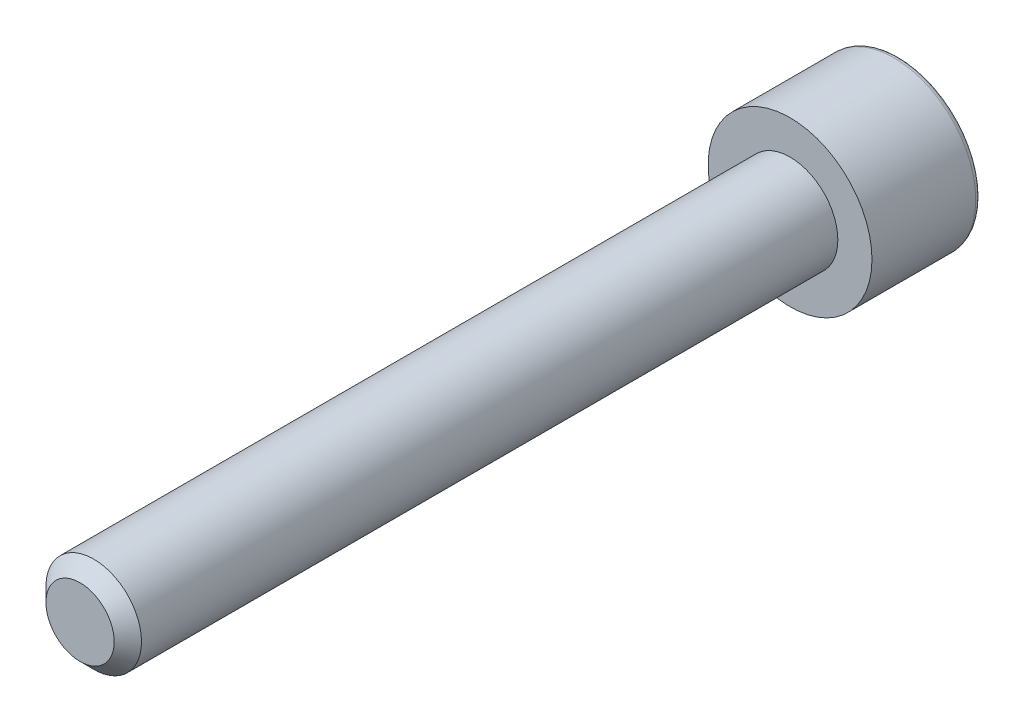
ISO-10303-21;
HEADER;
FILE_DESCRIPTION(('STEP AP214'),'2;1');
FILE_NAME('part.step','',(''),(''),'','','');
FILE_SCHEMA(('AUTOMOTIVE_DESIGN { 1 0 10303 214 1 1 1 1 }'));
ENDSEC;
DATA;
#1=APPLICATION_CONTEXT('core data for automotive mechanical design processes');
#2=APPLICATION_PROTOCOL_DEFINITION('international standard','automotive_design',2000,#1);
#3=PRODUCT_CONTEXT('',#1,'mechanical');
#4=PRODUCT('Part','Part','',(#3));
#5=PRODUCT_RELATED_PRODUCT_CATEGORY('part','',(#4));
#6=PRODUCT_DEFINITION_FORMATION('','',#4);
#7=PRODUCT_DEFINITION_CONTEXT('part definition',#1,'design');
#8=PRODUCT_DEFINITION('design','',#6,#7);
#9=PRODUCT_DEFINITION_SHAPE('','',#8);
#10=(LENGTH_UNIT() NAMED_UNIT(*) SI_UNIT(.MILLI.,.METRE.));
#11=(NAMED_UNIT(*) PLANE_ANGLE_UNIT() SI_UNIT($,.RADIAN.));
#12=(NAMED_UNIT(*) SI_UNIT($,.STERADIAN.) SOLID_ANGLE_UNIT());
#13=UNCERTAINTY_MEASURE_WITH_UNIT(LENGTH_MEASURE(1.E-05),#10,'distance_accuracy_value','');
#14=(GEOMETRIC_REPRESENTATION_CONTEXT(3) GLOBAL_UNCERTAINTY_ASSIGNED_CONTEXT((#13)) GLOBAL_UNIT_ASSIGNED_CONTEXT((#10,
#11,#12)) REPRESENTATION_CONTEXT('',''));
#15=CARTESIAN_POINT('',(0.,0.,0.));
#16=DIRECTION('',(0.,0.,1.));
#17=DIRECTION('',(1.,0.,0.));
#18=AXIS2_PLACEMENT_3D('',#15,#16,#17);
#19=CARTESIAN_POINT('',(0.,0.,30.));
#20=DIRECTION('',(0.,0.,-1.));
#21=DIRECTION('',(-1.,0.,0.));
#22=AXIS2_PLACEMENT_3D('',#19,#20,#21);
#23=CYLINDRICAL_SURFACE('',#22,3.);
#24=CARTESIAN_POINT('',(0.,0.,0.199999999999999));
#25=DIRECTION('',(0.,0.,1.));
#26=DIRECTION('',(1.,0.,0.));
#27=AXIS2_PLACEMENT_3D('',#24,#25,#26);
#28=CIRCLE('',#27,3.);
#29=CARTESIAN_POINT('',(3.,0.,0.199999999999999));
#30=VERTEX_POINT('',#29);
#31=EDGE_CURVE('E146',#30,#30,#28,.T.);
#32=ORIENTED_EDGE('',*,*,#31,.T.);
#33=EDGE_LOOP('',(#32));
#34=FACE_BOUND('',#33,.T.);
#35=CARTESIAN_POINT('',(0.,0.,4.));
#36=DIRECTION('',(0.,0.,1.));
#37=DIRECTION('',(1.,0.,0.));
#38=AXIS2_PLACEMENT_3D('',#35,#36,#37);
#39=CIRCLE('',#38,3.);
#40=CARTESIAN_POINT('',(3.,0.,4.));
#41=VERTEX_POINT('',#40);
#42=EDGE_CURVE('E183',#41,#41,#39,.T.);
#43=ORIENTED_EDGE('',*,*,#42,.F.);
#44=EDGE_LOOP('',(#43));
#45=FACE_BOUND('',#44,.T.);
#46=ADVANCED_FACE('F34',(#34,#45),#23,.T.);
#47=CARTESIAN_POINT('',(0.,0.,0.));
#48=DIRECTION('',(0.,0.,1.));
#49=DIRECTION('',(1.,0.,0.));
#50=AXIS2_PLACEMENT_3D('',#47,#48,#49);
#51=PLANE('',#50);
#52=DIRECTION('',(-0.5,0.866025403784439,0.));
#53=VECTOR('',#52,1.);
#54=CARTESIAN_POINT('',(-1.01036297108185,-1.75,0.));
#55=LINE('',#54,#53);
#56=CARTESIAN_POINT('',(-1.01036297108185,-1.75,0.));
#57=VERTEX_POINT('',#56);
#58=CARTESIAN_POINT('',(-2.02072594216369,0.,0.));
#59=VERTEX_POINT('',#58);
#60=EDGE_CURVE('E122',#57,#59,#55,.T.);
#61=ORIENTED_EDGE('',*,*,#60,.F.);
#62=DIRECTION('',(-1.,0.,0.));
#63=VECTOR('',#62,1.);
#64=CARTESIAN_POINT('',(1.01036297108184,-1.75,0.));
#65=LINE('',#64,#63);
#66=CARTESIAN_POINT('',(1.01036297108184,-1.75,0.));
#67=VERTEX_POINT('',#66);
#68=EDGE_CURVE('E127',#67,#57,#65,.T.);
#69=ORIENTED_EDGE('',*,*,#68,.F.);
#70=DIRECTION('',(-0.5,-0.866025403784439,0.));
#71=VECTOR('',#70,1.);
#72=CARTESIAN_POINT('',(2.02072594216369,0.,0.));
#73=LINE('',#72,#71);
#74=CARTESIAN_POINT('',(2.02072594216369,0.,0.));
#75=VERTEX_POINT('',#74);
#76=EDGE_CURVE('E141',#75,#67,#73,.T.);
#77=ORIENTED_EDGE('',*,*,#76,.F.);
#78=DIRECTION('',(0.5,-0.866025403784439,0.));
#79=VECTOR('',#78,1.);
#80=CARTESIAN_POINT('',(1.01036297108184,1.75,0.));
#81=LINE('',#80,#79);
#82=CARTESIAN_POINT('',(1.01036297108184,1.75,0.));
#83=VERTEX_POINT('',#82);
#84=EDGE_CURVE('E135',#83,#75,#81,.T.);
#85=ORIENTED_EDGE('',*,*,#84,.F.);
#86=DIRECTION('',(1.,0.,0.));
#87=VECTOR('',#86,1.);
#88=CARTESIAN_POINT('',(-1.01036297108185,1.75,0.));
#89=LINE('',#88,#87);
#90=CARTESIAN_POINT('',(-1.01036297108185,1.75,0.));
#91=VERTEX_POINT('',#90);
#92=EDGE_CURVE('E133',#91,#83,#89,.T.);
#93=ORIENTED_EDGE('',*,*,#92,.F.);
#94=DIRECTION('',(0.5,0.866025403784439,0.));
#95=VECTOR('',#94,1.);
#96=CARTESIAN_POINT('',(-2.02072594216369,0.,0.));
#97=LINE('',#96,#95);
#98=EDGE_CURVE('E111',#59,#91,#97,.T.);
#99=ORIENTED_EDGE('',*,*,#98,.F.);
#100=EDGE_LOOP('',(#61,#69,#77,#85,#93,#99));
#101=FACE_BOUND('',#100,.T.);
#102=CARTESIAN_POINT('',(0.,0.,0.));
#103=DIRECTION('',(0.,0.,1.));
#104=DIRECTION('',(1.,0.,0.));
#105=AXIS2_PLACEMENT_3D('',#102,#103,#104);
#106=CIRCLE('',#105,2.8);
#107=CARTESIAN_POINT('',(2.8,0.,0.));
#108=VERTEX_POINT('',#107);
#109=EDGE_CURVE('E155',#108,#108,#106,.F.);
#110=ORIENTED_EDGE('',*,*,#109,.T.);
#111=EDGE_LOOP('',(#110));
#112=FACE_BOUND('',#111,.T.);
#113=ADVANCED_FACE('F129',(#101,#112),#51,.F.);
#114=CARTESIAN_POINT('',(0.,0.,0.199999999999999));
#115=DIRECTION('',(0.,0.,1.));
#116=DIRECTION('',(1.,0.,0.));
#117=AXIS2_PLACEMENT_3D('',#114,#115,#116);
#118=TOROIDAL_SURFACE('',#117,2.8,0.2);
#119=ORIENTED_EDGE('',*,*,#109,.F.);
#120=EDGE_LOOP('',(#119));
#121=FACE_BOUND('',#120,.T.);
#122=ORIENTED_EDGE('',*,*,#31,.F.);
#123=EDGE_LOOP('',(#122));
#124=FACE_BOUND('',#123,.T.);
#125=ADVANCED_FACE('F218',(#121,#124),#118,.T.);
#126=CARTESIAN_POINT('',(1.01036297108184,-1.75,3.5));
#127=DIRECTION('',(0.,-1.,0.));
#128=DIRECTION('',(1.,0.,0.));
#129=AXIS2_PLACEMENT_3D('',#126,#127,#128);
#130=PLANE('',#129);
#131=DIRECTION('',(0.,0.,-1.));
#132=VECTOR('',#131,1.);
#133=CARTESIAN_POINT('',(-1.01036297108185,-1.75,3.5));
#134=LINE('',#133,#132);
#135=CARTESIAN_POINT('',(-1.01036297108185,-1.75,3.3));
#136=VERTEX_POINT('',#135);
#137=EDGE_CURVE('E119',#136,#57,#134,.T.);
#138=ORIENTED_EDGE('',*,*,#137,.F.);
#139=DIRECTION('',(-1.,0.,0.));
#140=VECTOR('',#139,1.);
#141=CARTESIAN_POINT('',(1.01036297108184,-1.75,3.3));
#142=LINE('',#141,#140);
#143=CARTESIAN_POINT('',(1.01036297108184,-1.75,3.3));
#144=VERTEX_POINT('',#143);
#145=EDGE_CURVE('E57',#136,#144,#142,.F.);
#146=ORIENTED_EDGE('',*,*,#145,.T.);
#147=DIRECTION('',(0.,0.,-1.));
#148=VECTOR('',#147,1.);
#149=CARTESIAN_POINT('',(1.01036297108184,-1.75,3.5));
#150=LINE('',#149,#148);
#151=EDGE_CURVE('E144',#144,#67,#150,.T.);
#152=ORIENTED_EDGE('',*,*,#151,.T.);
#153=ORIENTED_EDGE('',*,*,#68,.T.);
#154=EDGE_LOOP('',(#138,#146,#152,#153));
#155=FACE_BOUND('',#154,.T.);
#156=ADVANCED_FACE('F224',(#155),#130,.F.);
#157=CARTESIAN_POINT('',(2.02072594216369,0.,3.5));
#158=DIRECTION('',(0.866025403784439,-0.5,0.));
#159=DIRECTION('',(0.5,0.866025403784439,0.));
#160=AXIS2_PLACEMENT_3D('',#157,#158,#159);
#161=PLANE('',#160);
#162=ORIENTED_EDGE('',*,*,#151,.F.);
#163=DIRECTION('',(-0.5,-0.866025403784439,0.));
#164=VECTOR('',#163,1.);
#165=CARTESIAN_POINT('',(2.02072594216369,0.,3.3));
#166=LINE('',#165,#164);
#167=CARTESIAN_POINT('',(2.02072594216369,0.,3.3));
#168=VERTEX_POINT('',#167);
#169=EDGE_CURVE('E49',#144,#168,#166,.F.);
#170=ORIENTED_EDGE('',*,*,#169,.T.);
#171=DIRECTION('',(0.,0.,-1.));
#172=VECTOR('',#171,1.);
#173=CARTESIAN_POINT('',(2.02072594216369,0.,3.5));
#174=LINE('',#173,#172);
#175=EDGE_CURVE('E147',#168,#75,#174,.T.);
#176=ORIENTED_EDGE('',*,*,#175,.T.);
#177=ORIENTED_EDGE('',*,*,#76,.T.);
#178=EDGE_LOOP('',(#162,#170,#176,#177));
#179=FACE_BOUND('',#178,.T.);
#180=ADVANCED_FACE('F268',(#179),#161,.F.);
#181=CARTESIAN_POINT('',(1.01036297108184,1.75,3.5));
#182=DIRECTION('',(0.866025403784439,0.5,0.));
#183=DIRECTION('',(-0.5,0.866025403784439,0.));
#184=AXIS2_PLACEMENT_3D('',#181,#182,#183);
#185=PLANE('',#184);
#186=ORIENTED_EDGE('',*,*,#175,.F.);
#187=DIRECTION('',(0.5,-0.866025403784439,0.));
#188=VECTOR('',#187,1.);
#189=CARTESIAN_POINT('',(1.01036297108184,1.75,3.3));
#190=LINE('',#189,#188);
#191=CARTESIAN_POINT('',(1.01036297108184,1.75,3.3));
#192=VERTEX_POINT('',#191);
#193=EDGE_CURVE('E178',#168,#192,#190,.F.);
#194=ORIENTED_EDGE('',*,*,#193,.T.);
#195=DIRECTION('',(0.,0.,-1.));
#196=VECTOR('',#195,1.);
#197=CARTESIAN_POINT('',(1.01036297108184,1.75,3.5));
#198=LINE('',#197,#196);
#199=EDGE_CURVE('E149',#192,#83,#198,.T.);
#200=ORIENTED_EDGE('',*,*,#199,.T.);
#201=ORIENTED_EDGE('',*,*,#84,.T.);
#202=EDGE_LOOP('',(#186,#194,#200,#201));
#203=FACE_BOUND('',#202,.T.);
#204=ADVANCED_FACE('F266',(#203),#185,.F.);
#205=CARTESIAN_POINT('',(-1.01036297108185,1.75,3.5));
#206=DIRECTION('',(0.,1.,0.));
#207=DIRECTION('',(0.,0.,1.));
#208=AXIS2_PLACEMENT_3D('',#205,#206,#207);
#209=PLANE('',#208);
#210=ORIENTED_EDGE('',*,*,#199,.F.);
#211=DIRECTION('',(1.,0.,0.));
#212=VECTOR('',#211,1.);
#213=CARTESIAN_POINT('',(-1.01036297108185,1.75,3.3));
#214=LINE('',#213,#212);
#215=CARTESIAN_POINT('',(-1.01036297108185,1.75,3.3));
#216=VERTEX_POINT('',#215);
#217=EDGE_CURVE('E174',#192,#216,#214,.F.);
#218=ORIENTED_EDGE('',*,*,#217,.T.);
#219=DIRECTION('',(0.,0.,-1.));
#220=VECTOR('',#219,1.);
#221=CARTESIAN_POINT('',(-1.01036297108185,1.75,3.5));
#222=LINE('',#221,#220);
#223=EDGE_CURVE('E118',#216,#91,#222,.T.);
#224=ORIENTED_EDGE('',*,*,#223,.T.);
#225=ORIENTED_EDGE('',*,*,#92,.T.);
#226=EDGE_LOOP('',(#210,#218,#224,#225));
#227=FACE_BOUND('',#226,.T.);
#228=ADVANCED_FACE('F264',(#227),#209,.F.);
#229=CARTESIAN_POINT('',(-2.02072594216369,0.,3.5));
#230=DIRECTION('',(-0.866025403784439,0.5,0.));
#231=DIRECTION('',(-0.5,-0.866025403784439,0.));
#232=AXIS2_PLACEMENT_3D('',#229,#230,#231);
#233=PLANE('',#232);
#234=ORIENTED_EDGE('',*,*,#223,.F.);
#235=DIRECTION('',(0.5,0.866025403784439,0.));
#236=VECTOR('',#235,1.);
#237=CARTESIAN_POINT('',(-2.02072594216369,0.,3.3));
#238=LINE('',#237,#236);
#239=CARTESIAN_POINT('',(-2.02072594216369,0.,3.3));
#240=VERTEX_POINT('',#239);
#241=EDGE_CURVE('E114',#216,#240,#238,.F.);
#242=ORIENTED_EDGE('',*,*,#241,.T.);
#243=DIRECTION('',(0.,0.,-1.));
#244=VECTOR('',#243,1.);
#245=CARTESIAN_POINT('',(-2.02072594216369,0.,3.5));
#246=LINE('',#245,#244);
#247=EDGE_CURVE('E106',#240,#59,#246,.T.);
#248=ORIENTED_EDGE('',*,*,#247,.T.);
#249=ORIENTED_EDGE('',*,*,#98,.T.);
#250=EDGE_LOOP('',(#234,#242,#248,#249));
#251=FACE_BOUND('',#250,.T.);
#252=ADVANCED_FACE('F109',(#251),#233,.F.);
#253=CARTESIAN_POINT('',(-1.01036297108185,-1.75,3.5));
#254=DIRECTION('',(-0.866025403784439,-0.5,0.));
#255=DIRECTION('',(0.5,-0.866025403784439,0.));
#256=AXIS2_PLACEMENT_3D('',#253,#254,#255);
#257=PLANE('',#256);
#258=ORIENTED_EDGE('',*,*,#247,.F.);
#259=DIRECTION('',(-0.5,0.866025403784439,0.));
#260=VECTOR('',#259,1.);
#261=CARTESIAN_POINT('',(-1.01036297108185,-1.75,3.3));
#262=LINE('',#261,#260);
#263=EDGE_CURVE('E171',#240,#136,#262,.F.);
#264=ORIENTED_EDGE('',*,*,#263,.T.);
#265=ORIENTED_EDGE('',*,*,#137,.T.);
#266=ORIENTED_EDGE('',*,*,#60,.T.);
#267=EDGE_LOOP('',(#258,#264,#265,#266));
#268=FACE_BOUND('',#267,.T.);
#269=ADVANCED_FACE('F123',(#268),#257,.F.);
#270=CARTESIAN_POINT('',(0.,0.,3.5));
#271=DIRECTION('',(0.,0.,-1.));
#272=DIRECTION('',(-1.,0.,0.));
#273=AXIS2_PLACEMENT_3D('',#270,#271,#272);
#274=PLANE('',#273);
#275=DIRECTION('',(-1.,0.,0.));
#276=VECTOR('',#275,1.);
#277=CARTESIAN_POINT('',(0.,-1.55,3.5));
#278=LINE('',#277,#276);
#279=CARTESIAN_POINT('',(0.89489291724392,-1.55,3.5));
#280=VERTEX_POINT('',#279);
#281=CARTESIAN_POINT('',(-0.89489291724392,-1.55,3.5));
#282=VERTEX_POINT('',#281);
#283=EDGE_CURVE('E162',#280,#282,#278,.T.);
#284=ORIENTED_EDGE('',*,*,#283,.T.);
#285=DIRECTION('',(-0.5,0.866025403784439,0.));
#286=VECTOR('',#285,1.);
#287=CARTESIAN_POINT('',(-1.34233937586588,-0.775,3.5));
#288=LINE('',#287,#286);
#289=CARTESIAN_POINT('',(-1.78978583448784,0.,3.5));
#290=VERTEX_POINT('',#289);
#291=EDGE_CURVE('E168',#282,#290,#288,.T.);
#292=ORIENTED_EDGE('',*,*,#291,.T.);
#293=DIRECTION('',(0.5,0.866025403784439,0.));
#294=VECTOR('',#293,1.);
#295=CARTESIAN_POINT('',(-1.34233937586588,0.775,3.5));
#296=LINE('',#295,#294);
#297=CARTESIAN_POINT('',(-0.89489291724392,1.55,3.5));
#298=VERTEX_POINT('',#297);
#299=EDGE_CURVE('E166',#290,#298,#296,.T.);
#300=ORIENTED_EDGE('',*,*,#299,.T.);
#301=DIRECTION('',(1.,0.,0.));
#302=VECTOR('',#301,1.);
#303=CARTESIAN_POINT('',(0.,1.55,3.5));
#304=LINE('',#303,#302);
#305=CARTESIAN_POINT('',(0.89489291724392,1.55,3.5));
#306=VERTEX_POINT('',#305);
#307=EDGE_CURVE('E164',#298,#306,#304,.T.);
#308=ORIENTED_EDGE('',*,*,#307,.T.);
#309=DIRECTION('',(0.5,-0.866025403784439,0.));
#310=VECTOR('',#309,1.);
#311=CARTESIAN_POINT('',(1.34233937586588,0.775,3.5));
#312=LINE('',#311,#310);
#313=CARTESIAN_POINT('',(1.78978583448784,0.,3.5));
#314=VERTEX_POINT('',#313);
#315=EDGE_CURVE('E158',#306,#314,#312,.T.);
#316=ORIENTED_EDGE('',*,*,#315,.T.);
#317=DIRECTION('',(-0.5,-0.866025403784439,0.));
#318=VECTOR('',#317,1.);
#319=CARTESIAN_POINT('',(1.34233937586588,-0.775,3.5));
#320=LINE('',#319,#318);
#321=EDGE_CURVE('E160',#314,#280,#320,.T.);
#322=ORIENTED_EDGE('',*,*,#321,.T.);
#323=EDGE_LOOP('',(#284,#292,#300,#308,#316,#322));
#324=FACE_BOUND('',#323,.T.);
#325=ADVANCED_FACE('F248',(#324),#274,.T.);
#326=CARTESIAN_POINT('',(1.34233937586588,0.775,3.3));
#327=DIRECTION('',(0.5,-0.866025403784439,0.));
#328=DIRECTION('',(0.866025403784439,0.5,0.));
#329=AXIS2_PLACEMENT_3D('',#326,#327,#328);
#330=CYLINDRICAL_SURFACE('',#329,0.2);
#331=CARTESIAN_POINT('',(0.89489291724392,1.55,3.3));
#332=DIRECTION('',(0.866025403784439,-0.5,0.));
#333=DIRECTION('',(0.5,0.866025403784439,0.));
#334=AXIS2_PLACEMENT_3D('',#331,#332,#333);
#335=ELLIPSE('',#334,0.23094010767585,0.2);
#336=EDGE_CURVE('E191',#192,#306,#335,.T.);
#337=ORIENTED_EDGE('',*,*,#336,.F.);
#338=ORIENTED_EDGE('',*,*,#193,.F.);
#339=CARTESIAN_POINT('',(1.78978583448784,0.,3.3));
#340=DIRECTION('',(0.,-1.,0.));
#341=DIRECTION('',(-1.,0.,0.));
#342=AXIS2_PLACEMENT_3D('',#339,#340,#341);
#343=ELLIPSE('',#342,0.23094010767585,0.2);
#344=EDGE_CURVE('E194',#314,#168,#343,.F.);
#345=ORIENTED_EDGE('',*,*,#344,.F.);
#346=ORIENTED_EDGE('',*,*,#315,.F.);
#347=EDGE_LOOP('',(#337,#338,#345,#346));
#348=FACE_BOUND('',#347,.T.);
#349=ADVANCED_FACE('F245',(#348),#330,.F.);
#350=CARTESIAN_POINT('',(1.34233937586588,-0.775,3.3));
#351=DIRECTION('',(-0.5,-0.866025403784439,0.));
#352=DIRECTION('',(0.866025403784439,-0.5,0.));
#353=AXIS2_PLACEMENT_3D('',#350,#351,#352);
#354=CYLINDRICAL_SURFACE('',#353,0.2);
#355=ORIENTED_EDGE('',*,*,#344,.T.);
#356=ORIENTED_EDGE('',*,*,#169,.F.);
#357=CARTESIAN_POINT('',(0.89489291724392,-1.55,3.3));
#358=DIRECTION('',(-0.866025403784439,-0.5,0.));
#359=DIRECTION('',(-0.5,0.866025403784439,0.));
#360=AXIS2_PLACEMENT_3D('',#357,#358,#359);
#361=ELLIPSE('',#360,0.23094010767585,0.2);
#362=EDGE_CURVE('E188',#280,#144,#361,.F.);
#363=ORIENTED_EDGE('',*,*,#362,.F.);
#364=ORIENTED_EDGE('',*,*,#321,.F.);
#365=EDGE_LOOP('',(#355,#356,#363,#364));
#366=FACE_BOUND('',#365,.T.);
#367=ADVANCED_FACE('F242',(#366),#354,.F.);
#368=CARTESIAN_POINT('',(0.,1.55,3.3));
#369=DIRECTION('',(1.,0.,0.));
#370=DIRECTION('',(0.,0.,-1.));
#371=AXIS2_PLACEMENT_3D('',#368,#369,#370);
#372=CYLINDRICAL_SURFACE('',#371,0.2);
#373=ORIENTED_EDGE('',*,*,#336,.T.);
#374=ORIENTED_EDGE('',*,*,#307,.F.);
#375=CARTESIAN_POINT('',(-0.89489291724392,1.55,3.3));
#376=DIRECTION('',(0.866025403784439,0.5,0.));
#377=DIRECTION('',(-0.5,0.866025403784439,0.));
#378=AXIS2_PLACEMENT_3D('',#375,#376,#377);
#379=ELLIPSE('',#378,0.23094010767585,0.2);
#380=EDGE_CURVE('E185',#216,#298,#379,.T.);
#381=ORIENTED_EDGE('',*,*,#380,.F.);
#382=ORIENTED_EDGE('',*,*,#217,.F.);
#383=EDGE_LOOP('',(#373,#374,#381,#382));
#384=FACE_BOUND('',#383,.T.);
#385=ADVANCED_FACE('F238',(#384),#372,.F.);
#386=CARTESIAN_POINT('',(0.,-1.55,3.3));
#387=DIRECTION('',(-1.,0.,0.));
#388=DIRECTION('',(0.,-1.,0.));
#389=AXIS2_PLACEMENT_3D('',#386,#387,#388);
#390=CYLINDRICAL_SURFACE('',#389,0.2);
#391=ORIENTED_EDGE('',*,*,#362,.T.);
#392=ORIENTED_EDGE('',*,*,#145,.F.);
#393=CARTESIAN_POINT('',(-0.89489291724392,-1.55,3.3));
#394=DIRECTION('',(-0.866025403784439,0.5,0.));
#395=DIRECTION('',(0.5,0.866025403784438,0.));
#396=AXIS2_PLACEMENT_3D('',#393,#394,#395);
#397=ELLIPSE('',#396,0.23094010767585,0.2);
#398=EDGE_CURVE('E182',#282,#136,#397,.F.);
#399=ORIENTED_EDGE('',*,*,#398,.F.);
#400=ORIENTED_EDGE('',*,*,#283,.F.);
#401=EDGE_LOOP('',(#391,#392,#399,#400));
#402=FACE_BOUND('',#401,.T.);
#403=ADVANCED_FACE('F234',(#402),#390,.F.);
#404=CARTESIAN_POINT('',(-1.34233937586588,0.775,3.3));
#405=DIRECTION('',(0.5,0.866025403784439,0.));
#406=DIRECTION('',(-0.866025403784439,0.5,0.));
#407=AXIS2_PLACEMENT_3D('',#404,#405,#406);
#408=CYLINDRICAL_SURFACE('',#407,0.2);
#409=ORIENTED_EDGE('',*,*,#380,.T.);
#410=ORIENTED_EDGE('',*,*,#299,.F.);
#411=CARTESIAN_POINT('',(-1.78978583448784,0.,3.3));
#412=DIRECTION('',(0.,1.,0.));
#413=DIRECTION('',(-1.,0.,0.));
#414=AXIS2_PLACEMENT_3D('',#411,#412,#413);
#415=ELLIPSE('',#414,0.23094010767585,0.2);
#416=EDGE_CURVE('E180',#240,#290,#415,.T.);
#417=ORIENTED_EDGE('',*,*,#416,.F.);
#418=ORIENTED_EDGE('',*,*,#241,.F.);
#419=EDGE_LOOP('',(#409,#410,#417,#418));
#420=FACE_BOUND('',#419,.T.);
#421=ADVANCED_FACE('F230',(#420),#408,.F.);
#422=CARTESIAN_POINT('',(-1.34233937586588,-0.775,3.3));
#423=DIRECTION('',(-0.5,0.866025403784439,0.));
#424=DIRECTION('',(-0.866025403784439,-0.5,0.));
#425=AXIS2_PLACEMENT_3D('',#422,#423,#424);
#426=CYLINDRICAL_SURFACE('',#425,0.2);
#427=ORIENTED_EDGE('',*,*,#398,.T.);
#428=ORIENTED_EDGE('',*,*,#263,.F.);
#429=ORIENTED_EDGE('',*,*,#416,.T.);
#430=ORIENTED_EDGE('',*,*,#291,.F.);
#431=EDGE_LOOP('',(#427,#428,#429,#430));
#432=FACE_BOUND('',#431,.T.);
#433=ADVANCED_FACE('F226',(#432),#426,.F.);
#434=CARTESIAN_POINT('',(0.,0.,4.));
#435=DIRECTION('',(0.,0.,1.));
#436=DIRECTION('',(1.,0.,0.));
#437=AXIS2_PLACEMENT_3D('',#434,#435,#436);
#438=PLANE('',#437);
#439=CARTESIAN_POINT('',(0.,0.,4.));
#440=DIRECTION('',(0.,0.,1.));
#441=DIRECTION('',(1.,0.,0.));
#442=AXIS2_PLACEMENT_3D('',#439,#440,#441);
#443=CIRCLE('',#442,1.75);
#444=CARTESIAN_POINT('',(1.75,0.,4.));
#445=VERTEX_POINT('',#444);
#446=EDGE_CURVE('E198',#445,#445,#443,.T.);
#447=ORIENTED_EDGE('',*,*,#446,.F.);
#448=EDGE_LOOP('',(#447));
#449=FACE_BOUND('',#448,.T.);
#450=ORIENTED_EDGE('',*,*,#42,.T.);
#451=EDGE_LOOP('',(#450));
#452=FACE_BOUND('',#451,.T.);
#453=ADVANCED_FACE('F229',(#449,#452),#438,.T.);
#454=CARTESIAN_POINT('',(0.,0.,4.));
#455=DIRECTION('',(0.,0.,1.));
#456=DIRECTION('',(1.,0.,0.));
#457=AXIS2_PLACEMENT_3D('',#454,#455,#456);
#458=CYLINDRICAL_SURFACE('',#457,1.75);
#459=CARTESIAN_POINT('',(0.,0.,29.5));
#460=DIRECTION('',(0.,0.,1.));
#461=DIRECTION('',(1.,0.,0.));
#462=AXIS2_PLACEMENT_3D('',#459,#460,#461);
#463=CIRCLE('',#462,1.75);
#464=CARTESIAN_POINT('',(1.75,0.,29.5));
#465=VERTEX_POINT('',#464);
#466=EDGE_CURVE('E12',#465,#465,#463,.F.);
#467=CARTESIAN_POINT('',(1.75,0.,29.5));
#468=CARTESIAN_POINT('',(1.75,0.,29.234375));
#469=CARTESIAN_POINT('',(1.75,0.,28.96875));
#470=CARTESIAN_POINT('',(1.75,0.,28.4375));
#471=CARTESIAN_POINT('',(1.75,0.,28.171875));
#472=CARTESIAN_POINT('',(1.75,0.,27.640625));
#473=CARTESIAN_POINT('',(1.75,0.,27.375));
#474=CARTESIAN_POINT('',(1.75,0.,26.84375));
#475=CARTESIAN_POINT('',(1.75,0.,26.578125));
#476=CARTESIAN_POINT('',(1.75,0.,26.046875));
#477=CARTESIAN_POINT('',(1.75,0.,25.78125));
#478=CARTESIAN_POINT('',(1.75,0.,25.25));
#479=CARTESIAN_POINT('',(1.75,0.,24.984375));
#480=CARTESIAN_POINT('',(1.75,0.,24.453125));
#481=CARTESIAN_POINT('',(1.75,0.,24.1875));
#482=CARTESIAN_POINT('',(1.75,0.,23.65625));
#483=CARTESIAN_POINT('',(1.75,0.,23.390625));
#484=CARTESIAN_POINT('',(1.75,0.,22.859375));
#485=CARTESIAN_POINT('',(1.75,0.,22.59375));
#486=CARTESIAN_POINT('',(1.75,0.,22.0625));
#487=CARTESIAN_POINT('',(1.75,0.,21.796875));
#488=CARTESIAN_POINT('',(1.75,0.,21.265625));
#489=CARTESIAN_POINT('',(1.75,0.,21.));
#490=CARTESIAN_POINT('',(1.75,0.,20.46875));
#491=CARTESIAN_POINT('',(1.75,0.,20.203125));
#492=CARTESIAN_POINT('',(1.75,0.,19.671875));
#493=CARTESIAN_POINT('',(1.75,0.,19.40625));
#494=CARTESIAN_POINT('',(1.75,0.,18.875));
#495=CARTESIAN_POINT('',(1.75,0.,18.609375));
#496=CARTESIAN_POINT('',(1.75,0.,18.078125));
#497=CARTESIAN_POINT('',(1.75,0.,17.8125));
#498=CARTESIAN_POINT('',(1.75,0.,17.28125));
#499=CARTESIAN_POINT('',(1.75,0.,17.015625));
#500=CARTESIAN_POINT('',(1.75,0.,16.484375));
#501=CARTESIAN_POINT('',(1.75,0.,16.21875));
#502=CARTESIAN_POINT('',(1.75,0.,15.6875));
#503=CARTESIAN_POINT('',(1.75,0.,15.421875));
#504=CARTESIAN_POINT('',(1.75,0.,14.890625));
#505=CARTESIAN_POINT('',(1.75,0.,14.625));
#506=CARTESIAN_POINT('',(1.75,0.,14.09375));
#507=CARTESIAN_POINT('',(1.75,0.,13.828125));
#508=CARTESIAN_POINT('',(1.75,0.,13.296875));
#509=CARTESIAN_POINT('',(1.75,0.,13.03125));
#510=CARTESIAN_POINT('',(1.75,0.,12.5));
#511=CARTESIAN_POINT('',(1.75,0.,12.234375));
#512=CARTESIAN_POINT('',(1.75,0.,11.703125));
#513=CARTESIAN_POINT('',(1.75,0.,11.4375));
#514=CARTESIAN_POINT('',(1.75,0.,10.90625));
#515=CARTESIAN_POINT('',(1.75,0.,10.640625));
#516=CARTESIAN_POINT('',(1.75,0.,10.109375));
#517=CARTESIAN_POINT('',(1.75,0.,9.84375));
#518=CARTESIAN_POINT('',(1.75,0.,9.3125));
#519=CARTESIAN_POINT('',(1.75,0.,9.046875));
#520=CARTESIAN_POINT('',(1.75,0.,8.515625));
#521=CARTESIAN_POINT('',(1.75,0.,8.25));
#522=CARTESIAN_POINT('',(1.75,0.,7.71875));
#523=CARTESIAN_POINT('',(1.75,0.,7.453125));
#524=CARTESIAN_POINT('',(1.75,0.,6.921875));
#525=CARTESIAN_POINT('',(1.75,0.,6.65625));
#526=CARTESIAN_POINT('',(1.75,0.,6.125));
#527=CARTESIAN_POINT('',(1.75,0.,5.859375));
#528=CARTESIAN_POINT('',(1.75,0.,5.328125));
#529=CARTESIAN_POINT('',(1.75,0.,5.0625));
#530=CARTESIAN_POINT('',(1.75,0.,4.53125));
#531=CARTESIAN_POINT('',(1.75,0.,4.265625));
#532=CARTESIAN_POINT('',(1.75,0.,4.));
#533=B_SPLINE_CURVE_WITH_KNOTS('',3,(#467,#468,#469,#470,#471,#472,#473,#474,#475,#476,#477,
#478,#479,#480,#481,#482,#483,#484,#485,#486,#487,#488,#489,#490,#491,#492,#493,#494,#495,#496,
#497,#498,#499,#500,#501,#502,#503,#504,#505,#506,#507,#508,#509,#510,#511,#512,#513,#514,#515,
#516,#517,#518,#519,#520,#521,#522,#523,#524,#525,#526,#527,#528,#529,#530,#531,#532),
.UNSPECIFIED.,.F.,.F.,(4,2,2,2,2,2,2,2,2,2,2,2,2,2,2,2,2,2,2,2,2,2,2,2,2,2,2,2,2,2,2,2,4),(0.,
0.796874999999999,1.59375,2.390625,3.1875,3.984375,4.78125,5.578125,6.375,7.171875,7.96875,
8.765625,9.5625,10.359375,11.15625,11.953125,12.75,13.546875,14.34375,15.140625,15.9375,
16.734375,17.53125,18.328125,19.125,19.921875,20.71875,21.515625,22.3125,23.109375,23.90625,
24.703125,25.5),.UNSPECIFIED.);
#534=EDGE_CURVE('BSEAM209',#465,#445,#533,.T.);
#535=ORIENTED_EDGE('',*,*,#466,.T.);
#536=ORIENTED_EDGE('',*,*,#446,.T.);
#537=ORIENTED_EDGE('',*,*,#534,.T.);
#538=ORIENTED_EDGE('',*,*,#534,.F.);
#539=EDGE_LOOP('',(#535,#537,#536,#538));
#540=FACE_BOUND('',#539,.T.);
#541=ADVANCED_FACE('F209',(#540),#458,.T.);
#542=CARTESIAN_POINT('',(0.,0.,30.));
#543=DIRECTION('',(0.,0.,1.));
#544=DIRECTION('',(1.,0.,0.));
#545=AXIS2_PLACEMENT_3D('',#542,#543,#544);
#546=PLANE('',#545);
#547=CARTESIAN_POINT('',(0.,0.,30.));
#548=DIRECTION('',(0.,0.,1.));
#549=DIRECTION('',(1.,0.,0.));
#550=AXIS2_PLACEMENT_3D('',#547,#548,#549);
#551=CIRCLE('',#550,1.25000000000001);
#552=CARTESIAN_POINT('',(1.25000000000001,0.,30.));
#553=VERTEX_POINT('',#552);
#554=EDGE_CURVE('E42',#553,#553,#551,.T.);
#555=ORIENTED_EDGE('',*,*,#554,.T.);
#556=EDGE_LOOP('',(#555));
#557=FACE_BOUND('',#556,.T.);
#558=ADVANCED_FACE('F202',(#557),#546,.T.);
#559=CARTESIAN_POINT('',(0.,0.,30.));
#560=DIRECTION('',(0.,0.,-1.));
#561=DIRECTION('',(-1.,0.,0.));
#562=AXIS2_PLACEMENT_3D('',#559,#560,#561);
#563=CONICAL_SURFACE('',#562,1.25000000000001,0.78539816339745);
#564=ORIENTED_EDGE('',*,*,#466,.F.);
#565=EDGE_LOOP('',(#564));
#566=FACE_BOUND('',#565,.T.);
#567=ORIENTED_EDGE('',*,*,#554,.F.);
#568=EDGE_LOOP('',(#567));
#569=FACE_BOUND('',#568,.T.);
#570=ADVANCED_FACE('F36',(#566,#569),#563,.T.);
#571=CLOSED_SHELL('',(#46,#113,#125,#156,#180,#204,#228,#252,#269,#325,#349,#367,#385,#403,#421,
#433,#453,#541,#558,#570));
#572=MANIFOLD_SOLID_BREP('B2',#571);
#573=ADVANCED_BREP_SHAPE_REPRESENTATION('',(#18,#572),#14);
#574=SHAPE_DEFINITION_REPRESENTATION(#9,#573);
ENDSEC;
END-ISO-10303-21;
